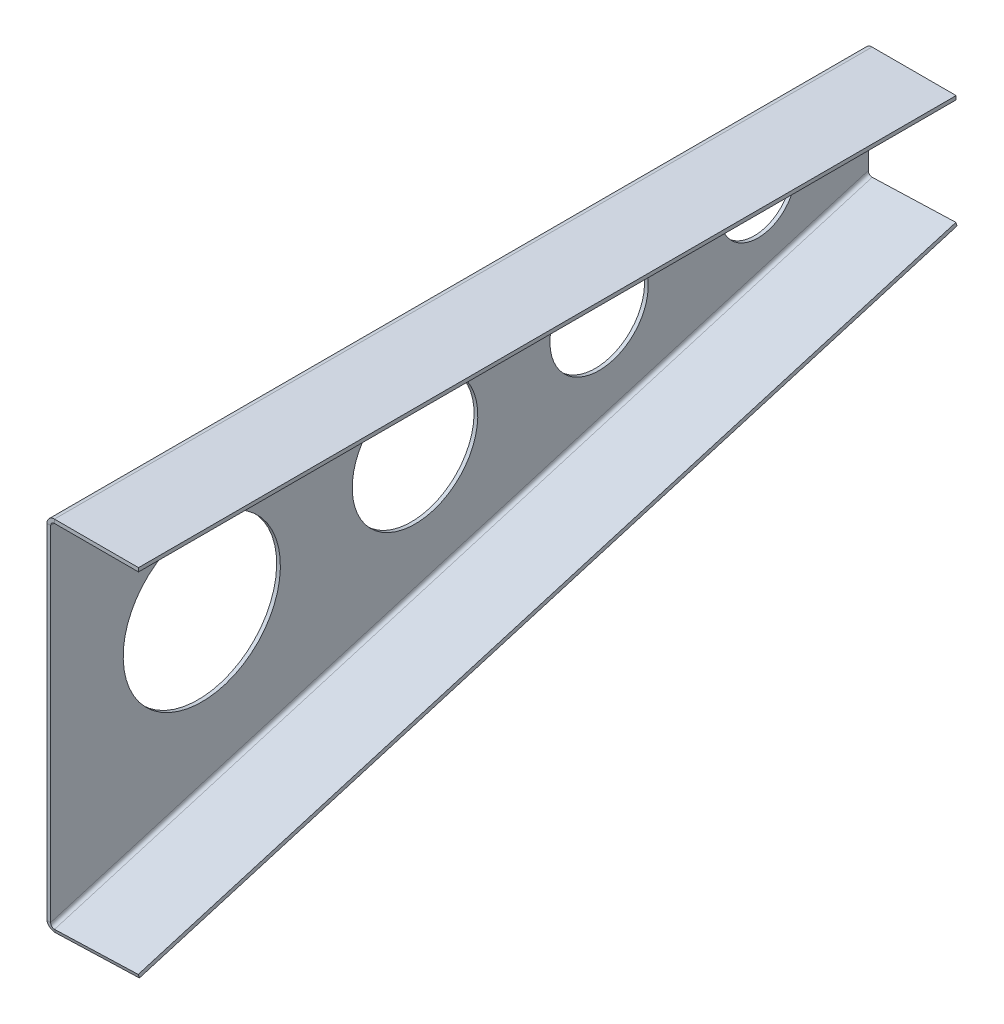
ISO-10303-21;
HEADER;
FILE_DESCRIPTION(('STEP AP214'),'2;1');
FILE_NAME('part.step','',(''),(''),'','','');
FILE_SCHEMA(('AUTOMOTIVE_DESIGN { 1 0 10303 214 1 1 1 1 }'));
ENDSEC;
DATA;
#1=APPLICATION_CONTEXT('core data for automotive mechanical design processes');
#2=APPLICATION_PROTOCOL_DEFINITION('international standard','automotive_design',2000,#1);
#3=PRODUCT_CONTEXT('',#1,'mechanical');
#4=PRODUCT('Part','Part','',(#3));
#5=PRODUCT_RELATED_PRODUCT_CATEGORY('part','',(#4));
#6=PRODUCT_DEFINITION_FORMATION('','',#4);
#7=PRODUCT_DEFINITION_CONTEXT('part definition',#1,'design');
#8=PRODUCT_DEFINITION('design','',#6,#7);
#9=PRODUCT_DEFINITION_SHAPE('','',#8);
#10=(LENGTH_UNIT() NAMED_UNIT(*) SI_UNIT(.MILLI.,.METRE.));
#11=(NAMED_UNIT(*) PLANE_ANGLE_UNIT() SI_UNIT($,.RADIAN.));
#12=(NAMED_UNIT(*) SI_UNIT($,.STERADIAN.) SOLID_ANGLE_UNIT());
#13=UNCERTAINTY_MEASURE_WITH_UNIT(LENGTH_MEASURE(1.E-05),#10,'distance_accuracy_value','');
#14=(GEOMETRIC_REPRESENTATION_CONTEXT(3) GLOBAL_UNCERTAINTY_ASSIGNED_CONTEXT((#13)) GLOBAL_UNIT_ASSIGNED_CONTEXT((#10,
#11,#12)) REPRESENTATION_CONTEXT('',''));
#15=CARTESIAN_POINT('',(0.,0.,0.));
#16=DIRECTION('',(0.,0.,1.));
#17=DIRECTION('',(1.,0.,0.));
#18=AXIS2_PLACEMENT_3D('',#15,#16,#17);
#19=CARTESIAN_POINT('',(-2551.0744,-1.62560000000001,-1431.41579922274));
#20=DIRECTION('',(0.,0.,1.));
#21=DIRECTION('',(0.,-1.,0.));
#22=AXIS2_PLACEMENT_3D('',#19,#20,#21);
#23=PLANE('',#22);
#24=DIRECTION('',(1.,0.,0.));
#25=VECTOR('',#24,1.);
#26=CARTESIAN_POINT('',(-2551.0744,-48.9649261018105,-1431.41579922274));
#27=LINE('',#26,#25);
#28=CARTESIAN_POINT('',(-2552.70000000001,-48.9649261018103,-1431.41579922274));
#29=VERTEX_POINT('',#28);
#30=CARTESIAN_POINT('',(-2551.0744,-48.9649261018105,-1431.41579922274));
#31=VERTEX_POINT('',#30);
#32=EDGE_CURVE('E12',#29,#31,#27,.T.);
#33=ORIENTED_EDGE('',*,*,#32,.F.);
#34=DIRECTION('',(0.,1.,0.));
#35=VECTOR('',#34,1.);
#36=CARTESIAN_POINT('',(-2552.70000000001,1.96301995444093E-11,-1431.41579922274));
#37=LINE('',#36,#35);
#38=CARTESIAN_POINT('',(-2552.70000000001,-4.87679999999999,-1431.41579922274));
#39=VERTEX_POINT('',#38);
#40=EDGE_CURVE('E139',#39,#29,#37,.F.);
#41=ORIENTED_EDGE('',*,*,#40,.F.);
#42=DIRECTION('',(1.,0.,0.));
#43=VECTOR('',#42,1.);
#44=CARTESIAN_POINT('',(-2551.0744,-4.8768,-1431.41579922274));
#45=LINE('',#44,#43);
#46=CARTESIAN_POINT('',(-2551.0744,-4.8768,-1431.41579922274));
#47=VERTEX_POINT('',#46);
#48=EDGE_CURVE('E92',#39,#47,#45,.T.);
#49=ORIENTED_EDGE('',*,*,#48,.T.);
#50=DIRECTION('',(0.,-1.,0.));
#51=VECTOR('',#50,1.);
#52=CARTESIAN_POINT('',(-2551.0744,-1.62560000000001,-1431.41579922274));
#53=LINE('',#52,#51);
#54=EDGE_CURVE('E141',#47,#31,#53,.T.);
#55=ORIENTED_EDGE('',*,*,#54,.T.);
#56=EDGE_LOOP('',(#33,#41,#49,#55));
#57=FACE_BOUND('',#56,.T.);
#58=ADVANCED_FACE('F81',(#57),#23,.F.);
#59=CARTESIAN_POINT('',(-2549.44880000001,-4.87680000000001,-1431.41579922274));
#60=DIRECTION('',(0.,0.,-1.));
#61=DIRECTION('',(-1.,0.,0.));
#62=AXIS2_PLACEMENT_3D('',#59,#60,#61);
#63=PLANE('',#62);
#64=ORIENTED_EDGE('',*,*,#48,.F.);
#65=CARTESIAN_POINT('',(-2549.44880000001,-4.87680000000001,-1431.41579922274));
#66=DIRECTION('',(0.,0.,1.));
#67=DIRECTION('',(1.,0.,0.));
#68=AXIS2_PLACEMENT_3D('',#65,#66,#67);
#69=CIRCLE('',#68,3.2512);
#70=CARTESIAN_POINT('',(-2549.44880000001,-1.62560000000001,-1431.41579922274));
#71=VERTEX_POINT('',#70);
#72=EDGE_CURVE('E350',#39,#71,#69,.F.);
#73=ORIENTED_EDGE('',*,*,#72,.T.);
#74=DIRECTION('',(0.,-1.,0.));
#75=VECTOR('',#74,1.);
#76=CARTESIAN_POINT('',(-2549.44880000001,-3.25120000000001,-1431.41579922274));
#77=LINE('',#76,#75);
#78=CARTESIAN_POINT('',(-2549.44880000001,-3.25120000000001,-1431.41579922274));
#79=VERTEX_POINT('',#78);
#80=EDGE_CURVE('E237',#71,#79,#77,.T.);
#81=ORIENTED_EDGE('',*,*,#80,.T.);
#82=CARTESIAN_POINT('',(-2549.44880000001,-4.87680000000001,-1431.41579922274));
#83=DIRECTION('',(0.,0.,1.));
#84=DIRECTION('',(1.,0.,0.));
#85=AXIS2_PLACEMENT_3D('',#82,#83,#84);
#86=CIRCLE('',#85,1.6256);
#87=EDGE_CURVE('E315',#47,#79,#86,.F.);
#88=ORIENTED_EDGE('',*,*,#87,.F.);
#89=EDGE_LOOP('',(#64,#73,#81,#88));
#90=FACE_BOUND('',#89,.T.);
#91=ADVANCED_FACE('F433',(#90),#63,.T.);
#92=CARTESIAN_POINT('',(-2552.7,-3.25120000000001,-1431.41579922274));
#93=DIRECTION('',(0.,0.,1.));
#94=DIRECTION('',(-1.,0.,0.));
#95=AXIS2_PLACEMENT_3D('',#92,#93,#94);
#96=PLANE('',#95);
#97=ORIENTED_EDGE('',*,*,#80,.F.);
#98=DIRECTION('',(1.,0.,0.));
#99=VECTOR('',#98,1.);
#100=CARTESIAN_POINT('',(0.,-1.6256,-1431.41579922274));
#101=LINE('',#100,#99);
#102=CARTESIAN_POINT('',(-2512.8756588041,-1.62560000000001,-1431.41579922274));
#103=VERTEX_POINT('',#102);
#104=EDGE_CURVE('E184',#103,#71,#101,.F.);
#105=ORIENTED_EDGE('',*,*,#104,.F.);
#106=DIRECTION('',(0.,-1.,0.));
#107=VECTOR('',#106,1.);
#108=CARTESIAN_POINT('',(-2512.8756588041,-3.25120000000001,-1431.41579922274));
#109=LINE('',#108,#107);
#110=CARTESIAN_POINT('',(-2512.8756588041,-3.25120000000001,-1431.41579922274));
#111=VERTEX_POINT('',#110);
#112=EDGE_CURVE('E233',#103,#111,#109,.T.);
#113=ORIENTED_EDGE('',*,*,#112,.T.);
#114=DIRECTION('',(-1.,0.,0.));
#115=VECTOR('',#114,1.);
#116=CARTESIAN_POINT('',(-2552.7,-3.25120000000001,-1431.41579922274));
#117=LINE('',#116,#115);
#118=EDGE_CURVE('E296',#111,#79,#117,.T.);
#119=ORIENTED_EDGE('',*,*,#118,.T.);
#120=EDGE_LOOP('',(#97,#105,#113,#119));
#121=FACE_BOUND('',#120,.T.);
#122=ADVANCED_FACE('F379',(#121),#96,.F.);
#123=CARTESIAN_POINT('',(-2512.8756588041,-3.25120000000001,-1431.41579922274));
#124=DIRECTION('',(-1.,0.,0.));
#125=DIRECTION('',(0.,0.,-1.));
#126=AXIS2_PLACEMENT_3D('',#123,#124,#125);
#127=PLANE('',#126);
#128=ORIENTED_EDGE('',*,*,#112,.F.);
#129=DIRECTION('',(0.,0.,1.));
#130=VECTOR('',#129,1.);
#131=CARTESIAN_POINT('',(-2512.8756588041,-1.62560000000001,0.));
#132=LINE('',#131,#130);
#133=CARTESIAN_POINT('',(-2512.8756588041,-1.62560000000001,-1075.81579922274));
#134=VERTEX_POINT('',#133);
#135=EDGE_CURVE('E195',#134,#103,#132,.F.);
#136=ORIENTED_EDGE('',*,*,#135,.F.);
#137=DIRECTION('',(0.,-1.,0.));
#138=VECTOR('',#137,1.);
#139=CARTESIAN_POINT('',(-2512.8756588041,-3.25120000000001,-1075.81579922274));
#140=LINE('',#139,#138);
#141=CARTESIAN_POINT('',(-2512.8756588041,-3.25120000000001,-1075.81579922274));
#142=VERTEX_POINT('',#141);
#143=EDGE_CURVE('E229',#134,#142,#140,.T.);
#144=ORIENTED_EDGE('',*,*,#143,.T.);
#145=DIRECTION('',(0.,0.,-1.));
#146=VECTOR('',#145,1.);
#147=CARTESIAN_POINT('',(-2512.8756588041,-3.25120000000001,-1431.41579922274));
#148=LINE('',#147,#146);
#149=EDGE_CURVE('E292',#142,#111,#148,.T.);
#150=ORIENTED_EDGE('',*,*,#149,.T.);
#151=EDGE_LOOP('',(#128,#136,#144,#150));
#152=FACE_BOUND('',#151,.T.);
#153=ADVANCED_FACE('F374',(#152),#127,.F.);
#154=CARTESIAN_POINT('',(-2512.8756588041,-3.25120000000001,-1075.81579922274));
#155=DIRECTION('',(0.,0.,-1.));
#156=DIRECTION('',(1.,0.,0.));
#157=AXIS2_PLACEMENT_3D('',#154,#155,#156);
#158=PLANE('',#157);
#159=ORIENTED_EDGE('',*,*,#143,.F.);
#160=DIRECTION('',(1.,0.,0.));
#161=VECTOR('',#160,1.);
#162=CARTESIAN_POINT('',(0.,-1.6256,-1075.81579922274));
#163=LINE('',#162,#161);
#164=CARTESIAN_POINT('',(-2549.4488,-1.62560000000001,-1075.81579922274));
#165=VERTEX_POINT('',#164);
#166=EDGE_CURVE('E179',#165,#134,#163,.T.);
#167=ORIENTED_EDGE('',*,*,#166,.F.);
#168=DIRECTION('',(0.,-1.,0.));
#169=VECTOR('',#168,1.);
#170=CARTESIAN_POINT('',(-2549.4488,-3.25120000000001,-1075.81579922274));
#171=LINE('',#170,#169);
#172=CARTESIAN_POINT('',(-2549.4488,-3.25120000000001,-1075.81579922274));
#173=VERTEX_POINT('',#172);
#174=EDGE_CURVE('E225',#165,#173,#171,.T.);
#175=ORIENTED_EDGE('',*,*,#174,.T.);
#176=DIRECTION('',(1.,0.,0.));
#177=VECTOR('',#176,1.);
#178=CARTESIAN_POINT('',(-2512.8756588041,-3.25120000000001,-1075.81579922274));
#179=LINE('',#178,#177);
#180=EDGE_CURVE('E300',#173,#142,#179,.T.);
#181=ORIENTED_EDGE('',*,*,#180,.T.);
#182=EDGE_LOOP('',(#159,#167,#175,#181));
#183=FACE_BOUND('',#182,.T.);
#184=ADVANCED_FACE('F368',(#183),#158,.F.);
#185=CARTESIAN_POINT('',(-2549.4488,-4.87680000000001,-1075.81579922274));
#186=DIRECTION('',(0.,0.,1.));
#187=DIRECTION('',(1.,0.,0.));
#188=AXIS2_PLACEMENT_3D('',#185,#186,#187);
#189=PLANE('',#188);
#190=ORIENTED_EDGE('',*,*,#174,.F.);
#191=CARTESIAN_POINT('',(-2549.4488,-4.87680000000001,-1075.81579922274));
#192=DIRECTION('',(0.,0.,1.));
#193=DIRECTION('',(1.,0.,0.));
#194=AXIS2_PLACEMENT_3D('',#191,#192,#193);
#195=CIRCLE('',#194,3.2512);
#196=CARTESIAN_POINT('',(-2552.7,-4.87679999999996,-1075.81579922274));
#197=VERTEX_POINT('',#196);
#198=EDGE_CURVE('E186',#165,#197,#195,.T.);
#199=ORIENTED_EDGE('',*,*,#198,.T.);
#200=DIRECTION('',(1.,0.,0.));
#201=VECTOR('',#200,1.);
#202=CARTESIAN_POINT('',(-2551.0744,-4.87679999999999,-1075.81579922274));
#203=LINE('',#202,#201);
#204=CARTESIAN_POINT('',(-2551.0744,-4.87679999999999,-1075.81579922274));
#205=VERTEX_POINT('',#204);
#206=EDGE_CURVE('E222',#197,#205,#203,.T.);
#207=ORIENTED_EDGE('',*,*,#206,.T.);
#208=CARTESIAN_POINT('',(-2549.4488,-4.87680000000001,-1075.81579922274));
#209=DIRECTION('',(0.,0.,-1.));
#210=DIRECTION('',(-1.,0.,0.));
#211=AXIS2_PLACEMENT_3D('',#208,#209,#210);
#212=CIRCLE('',#211,1.6256);
#213=EDGE_CURVE('E311',#173,#205,#212,.F.);
#214=ORIENTED_EDGE('',*,*,#213,.F.);
#215=EDGE_LOOP('',(#190,#199,#207,#214));
#216=FACE_BOUND('',#215,.T.);
#217=ADVANCED_FACE('F362',(#216),#189,.T.);
#218=CARTESIAN_POINT('',(-2551.0744,-157.860490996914,-1075.81579922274));
#219=DIRECTION('',(0.,0.,-1.));
#220=DIRECTION('',(0.,1.,0.));
#221=AXIS2_PLACEMENT_3D('',#218,#219,#220);
#222=PLANE('',#221);
#223=ORIENTED_EDGE('',*,*,#206,.F.);
#224=DIRECTION('',(0.,1.,0.));
#225=VECTOR('',#224,1.);
#226=CARTESIAN_POINT('',(-2552.7,1.96301995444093E-11,-1075.81579922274));
#227=LINE('',#226,#225);
#228=CARTESIAN_POINT('',(-2552.7,-154.429226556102,-1075.81579922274));
#229=VERTEX_POINT('',#228);
#230=EDGE_CURVE('E171',#229,#197,#227,.T.);
#231=ORIENTED_EDGE('',*,*,#230,.F.);
#232=DIRECTION('',(1.,0.,0.));
#233=VECTOR('',#232,1.);
#234=CARTESIAN_POINT('',(-2551.0744,-154.429226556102,-1075.81579922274));
#235=LINE('',#234,#233);
#236=CARTESIAN_POINT('',(-2551.0744,-154.429226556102,-1075.81579922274));
#237=VERTEX_POINT('',#236);
#238=EDGE_CURVE('E218',#229,#237,#235,.T.);
#239=ORIENTED_EDGE('',*,*,#238,.T.);
#240=DIRECTION('',(0.,1.,0.));
#241=VECTOR('',#240,1.);
#242=CARTESIAN_POINT('',(-2551.0744,-157.860490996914,-1075.81579922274));
#243=LINE('',#242,#241);
#244=EDGE_CURVE('E270',#237,#205,#243,.T.);
#245=ORIENTED_EDGE('',*,*,#244,.T.);
#246=EDGE_LOOP('',(#223,#231,#239,#245));
#247=FACE_BOUND('',#246,.T.);
#248=ADVANCED_FACE('F481',(#247),#222,.F.);
#249=CARTESIAN_POINT('',(-2549.4488,-151.175137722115,-1075.35357695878));
#250=CARTESIAN_POINT('',(-2549.4488,-151.694638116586,-1075.50765104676));
#251=CARTESIAN_POINT('',(-2549.4488,-152.214138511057,-1075.66172513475));
#252=CARTESIAN_POINT('',(-2549.4488,-152.733638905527,-1075.81579922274));
#253=CARTESIAN_POINT('',(-2555.9512,-151.175137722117,-1075.35357695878));
#254=CARTESIAN_POINT('',(-2554.86746666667,-151.694638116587,-1075.50765104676));
#255=CARTESIAN_POINT('',(-2553.78373333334,-152.214138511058,-1075.66172513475));
#256=CARTESIAN_POINT('',(-2552.7,-152.733638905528,-1075.81579922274));
#257=CARTESIAN_POINT('',(-2555.9512,-157.683315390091,-1076.2780214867));
#258=CARTESIAN_POINT('',(-2554.86746666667,-157.163814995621,-1076.12394739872));
#259=CARTESIAN_POINT('',(-2553.78373333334,-156.64431460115,-1075.96987331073));
#260=CARTESIAN_POINT('',(-2552.7,-156.124814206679,-1075.81579922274));
#261=CARTESIAN_POINT('',(-2549.4488,-157.68331539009,-1076.2780214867));
#262=CARTESIAN_POINT('',(-2549.4488,-157.163814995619,-1076.12394739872));
#263=CARTESIAN_POINT('',(-2549.4488,-156.644314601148,-1075.96987331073));
#264=CARTESIAN_POINT('',(-2549.4488,-156.124814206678,-1075.81579922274));
#265=CARTESIAN_POINT('',(-2542.9464,-157.683315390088,-1076.2780214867));
#266=CARTESIAN_POINT('',(-2544.03013333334,-157.163814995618,-1076.12394739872));
#267=CARTESIAN_POINT('',(-2545.11386666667,-156.644314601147,-1075.96987331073));
#268=CARTESIAN_POINT('',(-2546.1976,-156.124814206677,-1075.81579922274));
#269=CARTESIAN_POINT('',(-2542.9464,-151.175137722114,-1075.35357695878));
#270=CARTESIAN_POINT('',(-2544.03013333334,-151.694638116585,-1075.50765104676));
#271=CARTESIAN_POINT('',(-2545.11386666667,-152.214138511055,-1075.66172513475));
#272=CARTESIAN_POINT('',(-2546.1976,-152.733638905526,-1075.81579922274));
#273=CARTESIAN_POINT('',(-2549.4488,-151.175137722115,-1075.35357695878));
#274=CARTESIAN_POINT('',(-2549.4488,-151.694638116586,-1075.50765104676));
#275=CARTESIAN_POINT('',(-2549.4488,-152.214138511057,-1075.66172513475));
#276=CARTESIAN_POINT('',(-2549.4488,-152.733638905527,-1075.81579922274));
#277=(BOUNDED_SURFACE() B_SPLINE_SURFACE(3,3,((#249,#250,#251,#252),(#253,#254,#255,#256),(#257,
#258,#259,#260),(#261,#262,#263,#264),(#265,#266,#267,#268),(#269,#270,#271,#272),(#273,#274,
#275,#276)),.UNSPECIFIED.,.T.,.F.,.F.) B_SPLINE_SURFACE_WITH_KNOTS((4,3,4),(4,4),(0.,0.5,1.),
(0.,1.),.UNSPECIFIED.) GEOMETRIC_REPRESENTATION_ITEM() RATIONAL_B_SPLINE_SURFACE(((1.,1.,1.,1.),
(0.333333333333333,0.333333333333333,0.333333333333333,0.333333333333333),(0.333333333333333,
0.333333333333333,0.333333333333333,0.333333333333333),(1.,1.,1.,1.),(0.333333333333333,
0.333333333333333,0.333333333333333,0.333333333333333),(0.333333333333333,0.333333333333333,
0.333333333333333,0.333333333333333),(1.,1.,1.,1.))) REPRESENTATION_ITEM('') SURFACE());
#278=CARTESIAN_POINT('',(-2549.4488,-154.429226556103,-1075.81579922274));
#279=DIRECTION('',(0.,0.140631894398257,-0.990061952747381));
#280=DIRECTION('',(-2.70229764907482E-13,0.990061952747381,0.140631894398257));
#281=AXIS2_PLACEMENT_3D('',#278,#279,#280);
#282=ELLIPSE('',#281,3.28675273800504,3.2512);
#283=CARTESIAN_POINT('',(-2549.34416356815,-157.681629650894,-1076.27778203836));
#284=VERTEX_POINT('',#283);
#285=EDGE_CURVE('E157',#229,#284,#282,.F.);
#286=DIRECTION('',(-0.0321839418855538,0.95822700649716,0.28419218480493));
#287=VECTOR('',#286,1.);
#288=CARTESIAN_POINT('',(-2549.39648178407,-156.123935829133,-1075.81579922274));
#289=LINE('',#288,#287);
#290=CARTESIAN_POINT('',(-2549.39648178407,-156.123935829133,-1075.81579922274));
#291=VERTEX_POINT('',#290);
#292=EDGE_CURVE('E214',#284,#291,#289,.T.);
#293=CARTESIAN_POINT('',(-2549.4488,-154.429226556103,-1075.81579922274));
#294=DIRECTION('',(0.,0.,-1.));
#295=DIRECTION('',(-2.0160959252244E-13,1.,0.));
#296=AXIS2_PLACEMENT_3D('',#293,#294,#295);
#297=ELLIPSE('',#296,1.69558765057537,1.6256);
#298=EDGE_CURVE('E307',#237,#291,#297,.F.);
#299=ORIENTED_EDGE('',*,*,#238,.F.);
#300=ORIENTED_EDGE('',*,*,#285,.T.);
#301=ORIENTED_EDGE('',*,*,#292,.T.);
#302=ORIENTED_EDGE('',*,*,#298,.F.);
#303=EDGE_LOOP('',(#299,#300,#301,#302));
#304=FACE_BOUND('',#303,.T.);
#305=ADVANCED_FACE('F420',(#304),#277,.T.);
#306=CARTESIAN_POINT('',(-2552.7,-156.234890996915,-1075.81579922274));
#307=DIRECTION('',(-0.00953977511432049,0.284032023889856,-0.958767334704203));
#308=DIRECTION('',(-0.999436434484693,-0.0335680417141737,0.));
#309=AXIS2_PLACEMENT_3D('',#306,#307,#308);
#310=PLANE('',#309);
#311=ORIENTED_EDGE('',*,*,#292,.F.);
#312=DIRECTION('',(-0.999436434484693,-0.0335680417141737,0.));
#313=VECTOR('',#312,1.);
#314=CARTESIAN_POINT('',(-2552.64768178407,-157.792584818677,-1076.27778203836));
#315=LINE('',#314,#313);
#316=CARTESIAN_POINT('',(-2512.9435536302,-156.459043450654,-1076.27778203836));
#317=VERTEX_POINT('',#316);
#318=EDGE_CURVE('E330',#317,#284,#315,.T.);
#319=ORIENTED_EDGE('',*,*,#318,.F.);
#320=DIRECTION('',(-0.0321839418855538,0.95822700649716,0.28419218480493));
#321=VECTOR('',#320,1.);
#322=CARTESIAN_POINT('',(-2512.99587184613,-154.901349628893,-1075.81579922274));
#323=LINE('',#322,#321);
#324=CARTESIAN_POINT('',(-2512.99587184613,-154.901349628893,-1075.81579922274));
#325=VERTEX_POINT('',#324);
#326=EDGE_CURVE('E210',#317,#325,#323,.T.);
#327=ORIENTED_EDGE('',*,*,#326,.T.);
#328=DIRECTION('',(-0.999436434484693,-0.0335680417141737,0.));
#329=VECTOR('',#328,1.);
#330=CARTESIAN_POINT('',(-2552.7,-156.234890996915,-1075.81579922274));
#331=LINE('',#330,#329);
#332=EDGE_CURVE('E262',#325,#291,#331,.T.);
#333=ORIENTED_EDGE('',*,*,#332,.T.);
#334=EDGE_LOOP('',(#311,#319,#327,#333));
#335=FACE_BOUND('',#334,.T.);
#336=ADVANCED_FACE('F404',(#335),#310,.F.);
#337=CARTESIAN_POINT('',(-2512.99587184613,-154.901349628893,-1075.81579922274));
#338=DIRECTION('',(-0.999481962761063,-0.0308555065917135,-0.00915116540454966));
#339=DIRECTION('',(0.,-0.284339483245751,0.958723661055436));
#340=AXIS2_PLACEMENT_3D('',#337,#338,#339);
#341=PLANE('',#340);
#342=ORIENTED_EDGE('',*,*,#326,.F.);
#343=DIRECTION('',(0.,-0.284339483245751,0.958723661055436));
#344=VECTOR('',#343,1.);
#345=CARTESIAN_POINT('',(-2512.9435536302,-437.074609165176,-130.110266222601));
#346=LINE('',#345,#344);
#347=CARTESIAN_POINT('',(-2512.9435536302,-50.9947429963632,-1431.87778203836));
#348=VERTEX_POINT('',#347);
#349=EDGE_CURVE('E326',#348,#317,#346,.T.);
#350=ORIENTED_EDGE('',*,*,#349,.F.);
#351=DIRECTION('',(-0.0321839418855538,0.95822700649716,0.28419218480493));
#352=VECTOR('',#351,1.);
#353=CARTESIAN_POINT('',(-2512.99587184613,-49.4370491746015,-1431.41579922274));
#354=LINE('',#353,#352);
#355=CARTESIAN_POINT('',(-2512.99587184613,-49.4370491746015,-1431.41579922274));
#356=VERTEX_POINT('',#355);
#357=EDGE_CURVE('E206',#348,#356,#354,.T.);
#358=ORIENTED_EDGE('',*,*,#357,.T.);
#359=DIRECTION('',(0.,-0.284339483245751,0.958723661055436));
#360=VECTOR('',#359,1.);
#361=CARTESIAN_POINT('',(-2512.99587184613,-154.901349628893,-1075.81579922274));
#362=LINE('',#361,#360);
#363=EDGE_CURVE('E258',#356,#325,#362,.T.);
#364=ORIENTED_EDGE('',*,*,#363,.T.);
#365=EDGE_LOOP('',(#342,#350,#358,#364));
#366=FACE_BOUND('',#365,.T.);
#367=ADVANCED_FACE('F412',(#366),#341,.F.);
#368=CARTESIAN_POINT('',(-2512.99587184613,-49.4370491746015,-1431.41579922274));
#369=DIRECTION('',(0.00953977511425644,-0.284032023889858,0.958767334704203));
#370=DIRECTION('',(0.999436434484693,0.0335680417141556,1.17375926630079E-13));
#371=AXIS2_PLACEMENT_3D('',#368,#369,#370);
#372=PLANE('',#371);
#373=ORIENTED_EDGE('',*,*,#357,.F.);
#374=DIRECTION('',(0.999436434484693,0.0335680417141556,1.17375926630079E-13));
#375=VECTOR('',#374,1.);
#376=CARTESIAN_POINT('',(-2512.9435536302,-50.9947429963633,-1431.87778203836));
#377=LINE('',#376,#375);
#378=CARTESIAN_POINT('',(-2549.34416356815,-52.2173291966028,-1431.87778203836));
#379=VERTEX_POINT('',#378);
#380=EDGE_CURVE('E334',#379,#348,#377,.T.);
#381=ORIENTED_EDGE('',*,*,#380,.F.);
#382=DIRECTION('',(-0.03218394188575,0.958227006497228,0.284192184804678));
#383=VECTOR('',#382,1.);
#384=CARTESIAN_POINT('',(-2549.39648178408,-50.659635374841,-1431.41579922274));
#385=LINE('',#384,#383);
#386=CARTESIAN_POINT('',(-2549.39648178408,-50.659635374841,-1431.41579922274));
#387=VERTEX_POINT('',#386);
#388=EDGE_CURVE('E85',#379,#387,#385,.T.);
#389=ORIENTED_EDGE('',*,*,#388,.T.);
#390=DIRECTION('',(0.999436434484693,0.0335680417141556,1.17375926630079E-13));
#391=VECTOR('',#390,1.);
#392=CARTESIAN_POINT('',(-2512.99587184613,-49.4370491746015,-1431.41579922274));
#393=LINE('',#392,#391);
#394=EDGE_CURVE('E266',#387,#356,#393,.T.);
#395=ORIENTED_EDGE('',*,*,#394,.T.);
#396=EDGE_LOOP('',(#373,#381,#389,#395));
#397=FACE_BOUND('',#396,.T.);
#398=ADVANCED_FACE('F414',(#397),#372,.F.);
#399=CARTESIAN_POINT('',(-2551.07440000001,-34.1250645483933,-1383.44129820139));
#400=DIRECTION('',(1.,0.,0.));
#401=DIRECTION('',(0.,1.,0.));
#402=AXIS2_PLACEMENT_3D('',#399,#400,#401);
#403=CYLINDRICAL_SURFACE('',#402,16.2497322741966);
#404=CARTESIAN_POINT('',(-2551.07440000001,-34.1250645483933,-1383.44129820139));
#405=DIRECTION('',(1.,0.,0.));
#406=DIRECTION('',(0.,1.,0.));
#407=AXIS2_PLACEMENT_3D('',#404,#405,#406);
#408=CIRCLE('',#407,16.2497322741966);
#409=CARTESIAN_POINT('',(-2551.07440000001,-17.8753322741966,-1383.44129820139));
#410=VERTEX_POINT('',#409);
#411=EDGE_CURVE('E288',#410,#410,#408,.F.);
#412=ORIENTED_EDGE('',*,*,#411,.F.);
#413=EDGE_LOOP('',(#412));
#414=FACE_BOUND('',#413,.T.);
#415=CARTESIAN_POINT('',(-2552.70000000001,-34.1250645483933,-1383.44129820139));
#416=DIRECTION('',(1.,0.,0.));
#417=DIRECTION('',(0.,1.,0.));
#418=AXIS2_PLACEMENT_3D('',#415,#416,#417);
#419=CIRCLE('',#418,16.2497322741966);
#420=CARTESIAN_POINT('',(-2552.70000000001,-17.8753322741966,-1383.44129820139));
#421=VERTEX_POINT('',#420);
#422=EDGE_CURVE('E190',#421,#421,#419,.F.);
#423=ORIENTED_EDGE('',*,*,#422,.T.);
#424=EDGE_LOOP('',(#423));
#425=FACE_BOUND('',#424,.T.);
#426=ADVANCED_FACE('F445',(#414,#425),#403,.F.);
#427=CARTESIAN_POINT('',(-2551.0744,-44.3745850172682,-1314.3235121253));
#428=DIRECTION('',(1.,0.,0.));
#429=DIRECTION('',(0.,1.,0.));
#430=AXIS2_PLACEMENT_3D('',#427,#428,#429);
#431=CYLINDRICAL_SURFACE('',#430,21.3744925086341);
#432=CARTESIAN_POINT('',(-2551.0744,-44.3745850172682,-1314.3235121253));
#433=DIRECTION('',(1.,0.,0.));
#434=DIRECTION('',(0.,1.,0.));
#435=AXIS2_PLACEMENT_3D('',#432,#433,#434);
#436=CIRCLE('',#435,21.3744925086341);
#437=CARTESIAN_POINT('',(-2551.0744,-23.0000925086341,-1314.3235121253));
#438=VERTEX_POINT('',#437);
#439=EDGE_CURVE('E284',#438,#438,#436,.F.);
#440=ORIENTED_EDGE('',*,*,#439,.F.);
#441=EDGE_LOOP('',(#440));
#442=FACE_BOUND('',#441,.T.);
#443=CARTESIAN_POINT('',(-2552.70000000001,-44.3745850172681,-1314.3235121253));
#444=DIRECTION('',(1.,0.,0.));
#445=DIRECTION('',(0.,1.,0.));
#446=AXIS2_PLACEMENT_3D('',#443,#444,#445);
#447=CIRCLE('',#446,21.3744925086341);
#448=CARTESIAN_POINT('',(-2552.70000000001,-23.0000925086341,-1314.3235121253));
#449=VERTEX_POINT('',#448);
#450=EDGE_CURVE('E194',#449,#449,#447,.F.);
#451=ORIENTED_EDGE('',*,*,#450,.T.);
#452=EDGE_LOOP('',(#451));
#453=FACE_BOUND('',#452,.T.);
#454=ADVANCED_FACE('F453',(#442,#453),#431,.F.);
#455=CARTESIAN_POINT('',(-2551.0744,-56.2465694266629,-1234.26461754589));
#456=DIRECTION('',(1.,0.,0.));
#457=DIRECTION('',(0.,1.,0.));
#458=AXIS2_PLACEMENT_3D('',#455,#456,#457);
#459=CYLINDRICAL_SURFACE('',#458,27.3104847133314);
#460=CARTESIAN_POINT('',(-2551.0744,-56.2465694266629,-1234.26461754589));
#461=DIRECTION('',(1.,0.,0.));
#462=DIRECTION('',(0.,1.,0.));
#463=AXIS2_PLACEMENT_3D('',#460,#461,#462);
#464=CIRCLE('',#463,27.3104847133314);
#465=CARTESIAN_POINT('',(-2551.0744,-28.9360847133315,-1234.26461754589));
#466=VERTEX_POINT('',#465);
#467=EDGE_CURVE('E280',#466,#466,#464,.F.);
#468=ORIENTED_EDGE('',*,*,#467,.F.);
#469=EDGE_LOOP('',(#468));
#470=FACE_BOUND('',#469,.T.);
#471=CARTESIAN_POINT('',(-2552.7,-56.2465694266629,-1234.26461754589));
#472=DIRECTION('',(1.,0.,0.));
#473=DIRECTION('',(0.,1.,0.));
#474=AXIS2_PLACEMENT_3D('',#471,#472,#473);
#475=CIRCLE('',#474,27.3104847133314);
#476=CARTESIAN_POINT('',(-2552.7,-28.9360847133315,-1234.26461754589));
#477=VERTEX_POINT('',#476);
#478=EDGE_CURVE('E199',#477,#477,#475,.F.);
#479=ORIENTED_EDGE('',*,*,#478,.T.);
#480=EDGE_LOOP('',(#479));
#481=FACE_BOUND('',#480,.T.);
#482=ADVANCED_FACE('F456',(#470,#481),#459,.F.);
#483=CARTESIAN_POINT('',(-2551.0744,-69.9978482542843,-1141.53267450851));
#484=DIRECTION('',(1.,0.,0.));
#485=DIRECTION('',(0.,1.,0.));
#486=AXIS2_PLACEMENT_3D('',#483,#484,#485);
#487=CYLINDRICAL_SURFACE('',#486,34.1861241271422);
#488=CARTESIAN_POINT('',(-2551.0744,-69.9978482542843,-1141.53267450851));
#489=DIRECTION('',(1.,0.,0.));
#490=DIRECTION('',(0.,1.,0.));
#491=AXIS2_PLACEMENT_3D('',#488,#489,#490);
#492=CIRCLE('',#491,34.1861241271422);
#493=CARTESIAN_POINT('',(-2551.0744,-35.8117241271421,-1141.53267450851));
#494=VERTEX_POINT('',#493);
#495=EDGE_CURVE('E276',#494,#494,#492,.F.);
#496=ORIENTED_EDGE('',*,*,#495,.F.);
#497=EDGE_LOOP('',(#496));
#498=FACE_BOUND('',#497,.T.);
#499=CARTESIAN_POINT('',(-2552.7,-69.9978482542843,-1141.53267450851));
#500=DIRECTION('',(1.,0.,0.));
#501=DIRECTION('',(0.,1.,0.));
#502=AXIS2_PLACEMENT_3D('',#499,#500,#501);
#503=CIRCLE('',#502,34.1861241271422);
#504=CARTESIAN_POINT('',(-2552.7,-35.8117241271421,-1141.53267450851));
#505=VERTEX_POINT('',#504);
#506=EDGE_CURVE('E172',#505,#505,#503,.F.);
#507=ORIENTED_EDGE('',*,*,#506,.T.);
#508=EDGE_LOOP('',(#507));
#509=FACE_BOUND('',#508,.T.);
#510=ADVANCED_FACE('F83',(#498,#509),#487,.F.);
#511=CARTESIAN_POINT('',(-2549.44880000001,-45.7108372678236,-1430.95357695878));
#512=CARTESIAN_POINT('',(-2549.44880000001,-46.2303376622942,-1431.10765104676));
#513=CARTESIAN_POINT('',(-2549.44880000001,-46.7498380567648,-1431.26172513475));
#514=CARTESIAN_POINT('',(-2549.44880000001,-47.2693384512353,-1431.41579922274));
#515=CARTESIAN_POINT('',(-2542.94640000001,-45.7108372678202,-1430.95357695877));
#516=CARTESIAN_POINT('',(-2544.03013333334,-46.2303376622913,-1431.10765104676));
#517=CARTESIAN_POINT('',(-2545.11386666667,-46.7498380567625,-1431.26172513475));
#518=CARTESIAN_POINT('',(-2546.19760000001,-47.2693384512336,-1431.41579922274));
#519=CARTESIAN_POINT('',(-2542.9464,-52.2190149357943,-1431.8780214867));
#520=CARTESIAN_POINT('',(-2544.03013333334,-51.6995145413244,-1431.72394739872));
#521=CARTESIAN_POINT('',(-2545.11386666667,-51.1800141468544,-1431.56987331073));
#522=CARTESIAN_POINT('',(-2546.1976,-50.6605137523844,-1431.41579922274));
#523=CARTESIAN_POINT('',(-2549.4488,-52.2190149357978,-1431.8780214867));
#524=CARTESIAN_POINT('',(-2549.4488,-51.6995145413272,-1431.72394739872));
#525=CARTESIAN_POINT('',(-2549.4488,-51.1800141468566,-1431.56987331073));
#526=CARTESIAN_POINT('',(-2549.4488,-50.6605137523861,-1431.41579922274));
#527=CARTESIAN_POINT('',(-2555.9512,-52.2190149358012,-1431.87802148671));
#528=CARTESIAN_POINT('',(-2554.86746666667,-51.6995145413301,-1431.72394739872));
#529=CARTESIAN_POINT('',(-2553.78373333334,-51.1800141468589,-1431.56987331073));
#530=CARTESIAN_POINT('',(-2552.7,-50.6605137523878,-1431.41579922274));
#531=CARTESIAN_POINT('',(-2555.95120000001,-45.710837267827,-1430.95357695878));
#532=CARTESIAN_POINT('',(-2554.86746666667,-46.230337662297,-1431.10765104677));
#533=CARTESIAN_POINT('',(-2553.78373333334,-46.7498380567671,-1431.26172513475));
#534=CARTESIAN_POINT('',(-2552.70000000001,-47.269338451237,-1431.41579922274));
#535=CARTESIAN_POINT('',(-2549.44880000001,-45.7108372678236,-1430.95357695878));
#536=CARTESIAN_POINT('',(-2549.44880000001,-46.2303376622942,-1431.10765104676));
#537=CARTESIAN_POINT('',(-2549.44880000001,-46.7498380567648,-1431.26172513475));
#538=CARTESIAN_POINT('',(-2549.44880000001,-47.2693384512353,-1431.41579922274));
#539=(BOUNDED_SURFACE() B_SPLINE_SURFACE(3,3,((#511,#512,#513,#514),(#515,#516,#517,#518),(#519,
#520,#521,#522),(#523,#524,#525,#526),(#527,#528,#529,#530),(#531,#532,#533,#534),(#535,#536,
#537,#538)),.UNSPECIFIED.,.T.,.F.,.F.) B_SPLINE_SURFACE_WITH_KNOTS((4,3,4),(4,4),(0.,0.5,1.),
(0.,1.),.UNSPECIFIED.) GEOMETRIC_REPRESENTATION_ITEM() RATIONAL_B_SPLINE_SURFACE(((1.,1.,1.,1.),
(0.333333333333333,0.333333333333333,0.333333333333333,0.333333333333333),(0.333333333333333,
0.333333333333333,0.333333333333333,0.333333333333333),(1.,1.,1.,1.),(0.333333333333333,
0.333333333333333,0.333333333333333,0.333333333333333),(0.333333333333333,0.333333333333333,
0.333333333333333,0.333333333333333),(1.,1.,1.,1.))) REPRESENTATION_ITEM('') SURFACE());
#540=CARTESIAN_POINT('',(-2549.44880000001,-48.9649261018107,-1431.41579922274));
#541=DIRECTION('',(0.,-0.140631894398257,0.990061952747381));
#542=DIRECTION('',(-5.40459529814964E-13,0.990061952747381,0.140631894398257));
#543=AXIS2_PLACEMENT_3D('',#540,#541,#542);
#544=ELLIPSE('',#543,3.28675273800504,3.2512);
#545=EDGE_CURVE('E154',#379,#29,#544,.F.);
#546=CARTESIAN_POINT('',(-2549.44880000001,-48.9649261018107,-1431.41579922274));
#547=DIRECTION('',(-1.17442112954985E-13,0.,1.));
#548=DIRECTION('',(-4.09030974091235E-13,1.,0.));
#549=AXIS2_PLACEMENT_3D('',#546,#547,#548);
#550=ELLIPSE('',#549,1.69558765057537,1.6256);
#551=EDGE_CURVE('E304',#387,#31,#550,.F.);
#552=ORIENTED_EDGE('',*,*,#545,.T.);
#553=ORIENTED_EDGE('',*,*,#32,.T.);
#554=ORIENTED_EDGE('',*,*,#551,.F.);
#555=ORIENTED_EDGE('',*,*,#388,.F.);
#556=EDGE_LOOP('',(#552,#553,#554,#555));
#557=FACE_BOUND('',#556,.T.);
#558=ADVANCED_FACE('F175',(#557),#539,.T.);
#559=CARTESIAN_POINT('',(12.0641081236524,-357.564528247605,-106.529065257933));
#560=DIRECTION('',(-0.0321839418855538,0.95822700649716,0.28419218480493));
#561=DIRECTION('',(0.,-0.284339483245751,0.958723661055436));
#562=AXIS2_PLACEMENT_3D('',#559,#560,#561);
#563=PLANE('',#562);
#564=ORIENTED_EDGE('',*,*,#394,.F.);
#565=DIRECTION('',(0.,-0.284339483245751,0.958723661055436));
#566=VECTOR('',#565,1.);
#567=CARTESIAN_POINT('',(-2549.39648178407,-156.128492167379,-1075.80043635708));
#568=LINE('',#567,#566);
#569=EDGE_CURVE('E254',#387,#291,#568,.T.);
#570=ORIENTED_EDGE('',*,*,#569,.T.);
#571=ORIENTED_EDGE('',*,*,#332,.F.);
#572=ORIENTED_EDGE('',*,*,#363,.F.);
#573=EDGE_LOOP('',(#564,#570,#571,#572));
#574=FACE_BOUND('',#573,.T.);
#575=ADVANCED_FACE('F410',(#574),#563,.T.);
#576=CARTESIAN_POINT('',(-2551.0744,1.96177066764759E-11,1.56963117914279E-11));
#577=DIRECTION('',(1.,0.,0.));
#578=DIRECTION('',(0.,1.,0.));
#579=AXIS2_PLACEMENT_3D('',#576,#577,#578);
#580=PLANE('',#579);
#581=ORIENTED_EDGE('',*,*,#411,.T.);
#582=EDGE_LOOP('',(#581));
#583=FACE_BOUND('',#582,.T.);
#584=ORIENTED_EDGE('',*,*,#439,.T.);
#585=EDGE_LOOP('',(#584));
#586=FACE_BOUND('',#585,.T.);
#587=ORIENTED_EDGE('',*,*,#467,.T.);
#588=EDGE_LOOP('',(#587));
#589=FACE_BOUND('',#588,.T.);
#590=ORIENTED_EDGE('',*,*,#495,.T.);
#591=EDGE_LOOP('',(#590));
#592=FACE_BOUND('',#591,.T.);
#593=ORIENTED_EDGE('',*,*,#54,.F.);
#594=DIRECTION('',(0.,0.,-1.));
#595=VECTOR('',#594,1.);
#596=CARTESIAN_POINT('',(-2551.0744,-4.8768,-1075.81579922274));
#597=LINE('',#596,#595);
#598=EDGE_CURVE('E244',#47,#205,#597,.F.);
#599=ORIENTED_EDGE('',*,*,#598,.T.);
#600=ORIENTED_EDGE('',*,*,#244,.F.);
#601=DIRECTION('',(0.,-0.284339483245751,0.958723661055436));
#602=VECTOR('',#601,1.);
#603=CARTESIAN_POINT('',(-2551.07440000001,-49.1064978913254,-1430.93845354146));
#604=LINE('',#603,#602);
#605=EDGE_CURVE('E251',#237,#31,#604,.F.);
#606=ORIENTED_EDGE('',*,*,#605,.T.);
#607=EDGE_LOOP('',(#593,#599,#600,#606));
#608=FACE_BOUND('',#607,.T.);
#609=ADVANCED_FACE('F472',(#583,#586,#589,#592,#608),#580,.T.);
#610=CARTESIAN_POINT('',(0.,-3.2512,0.));
#611=DIRECTION('',(0.,-1.,0.));
#612=DIRECTION('',(1.,0.,0.));
#613=AXIS2_PLACEMENT_3D('',#610,#611,#612);
#614=PLANE('',#613);
#615=ORIENTED_EDGE('',*,*,#180,.F.);
#616=DIRECTION('',(0.,0.,-1.));
#617=VECTOR('',#616,1.);
#618=CARTESIAN_POINT('',(-2549.44880000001,-3.25120000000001,-1431.41579922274));
#619=LINE('',#618,#617);
#620=EDGE_CURVE('E247',#173,#79,#619,.T.);
#621=ORIENTED_EDGE('',*,*,#620,.T.);
#622=ORIENTED_EDGE('',*,*,#118,.F.);
#623=ORIENTED_EDGE('',*,*,#149,.F.);
#624=EDGE_LOOP('',(#615,#621,#622,#623));
#625=FACE_BOUND('',#624,.T.);
#626=ADVANCED_FACE('F382',(#625),#614,.T.);
#627=CARTESIAN_POINT('',(-2549.4488,-435.08296292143,-129.519581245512));
#628=DIRECTION('',(0.,0.284339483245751,-0.958723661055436));
#629=DIRECTION('',(0.,0.958723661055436,0.284339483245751));
#630=AXIS2_PLACEMENT_3D('',#627,#628,#629);
#631=CYLINDRICAL_SURFACE('',#630,1.6256);
#632=ORIENTED_EDGE('',*,*,#551,.T.);
#633=ORIENTED_EDGE('',*,*,#605,.F.);
#634=ORIENTED_EDGE('',*,*,#298,.T.);
#635=ORIENTED_EDGE('',*,*,#569,.F.);
#636=EDGE_LOOP('',(#632,#633,#634,#635));
#637=FACE_BOUND('',#636,.T.);
#638=ADVANCED_FACE('F417',(#637),#631,.F.);
#639=CARTESIAN_POINT('',(-2549.4488,-4.87680000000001,1.56741767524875E-11));
#640=DIRECTION('',(0.,0.,1.));
#641=DIRECTION('',(1.,0.,0.));
#642=AXIS2_PLACEMENT_3D('',#639,#640,#641);
#643=CYLINDRICAL_SURFACE('',#642,1.6256);
#644=ORIENTED_EDGE('',*,*,#213,.T.);
#645=ORIENTED_EDGE('',*,*,#598,.F.);
#646=ORIENTED_EDGE('',*,*,#87,.T.);
#647=ORIENTED_EDGE('',*,*,#620,.F.);
#648=EDGE_LOOP('',(#644,#645,#646,#647));
#649=FACE_BOUND('',#648,.T.);
#650=ADVANCED_FACE('F385',(#649),#643,.F.);
#651=CARTESIAN_POINT('',(12.1164263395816,-359.122222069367,-106.991048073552));
#652=DIRECTION('',(-0.0321839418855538,0.95822700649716,0.28419218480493));
#653=DIRECTION('',(0.,-0.284339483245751,0.958723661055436));
#654=AXIS2_PLACEMENT_3D('',#651,#652,#653);
#655=PLANE('',#654);
#656=ORIENTED_EDGE('',*,*,#380,.T.);
#657=ORIENTED_EDGE('',*,*,#349,.T.);
#658=ORIENTED_EDGE('',*,*,#318,.T.);
#659=DIRECTION('',(0.,-0.284339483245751,0.958723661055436));
#660=VECTOR('',#659,1.);
#661=CARTESIAN_POINT('',(-2549.34416356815,-438.198350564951,-130.443546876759));
#662=LINE('',#661,#660);
#663=EDGE_CURVE('E163',#379,#284,#662,.T.);
#664=ORIENTED_EDGE('',*,*,#663,.F.);
#665=EDGE_LOOP('',(#656,#657,#658,#664));
#666=FACE_BOUND('',#665,.T.);
#667=ADVANCED_FACE('F422',(#666),#655,.F.);
#668=CARTESIAN_POINT('',(-2552.7,1.96301995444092E-11,1.57063060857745E-11));
#669=DIRECTION('',(1.,0.,0.));
#670=DIRECTION('',(0.,1.,0.));
#671=AXIS2_PLACEMENT_3D('',#668,#669,#670);
#672=PLANE('',#671);
#673=ORIENTED_EDGE('',*,*,#422,.F.);
#674=EDGE_LOOP('',(#673));
#675=FACE_BOUND('',#674,.T.);
#676=ORIENTED_EDGE('',*,*,#450,.F.);
#677=EDGE_LOOP('',(#676));
#678=FACE_BOUND('',#677,.T.);
#679=ORIENTED_EDGE('',*,*,#478,.F.);
#680=EDGE_LOOP('',(#679));
#681=FACE_BOUND('',#680,.T.);
#682=ORIENTED_EDGE('',*,*,#506,.F.);
#683=EDGE_LOOP('',(#682));
#684=FACE_BOUND('',#683,.T.);
#685=ORIENTED_EDGE('',*,*,#40,.T.);
#686=DIRECTION('',(0.,0.284339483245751,-0.958723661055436));
#687=VECTOR('',#686,1.);
#688=CARTESIAN_POINT('',(-2552.7,-435.08296292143,-129.519581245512));
#689=LINE('',#688,#687);
#690=EDGE_CURVE('E151',#229,#29,#689,.T.);
#691=ORIENTED_EDGE('',*,*,#690,.F.);
#692=ORIENTED_EDGE('',*,*,#230,.T.);
#693=DIRECTION('',(0.,0.,1.));
#694=VECTOR('',#693,1.);
#695=CARTESIAN_POINT('',(-2552.7,-4.87679999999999,1.57063060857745E-11));
#696=LINE('',#695,#694);
#697=EDGE_CURVE('E168',#39,#197,#696,.T.);
#698=ORIENTED_EDGE('',*,*,#697,.F.);
#699=EDGE_LOOP('',(#685,#691,#692,#698));
#700=FACE_BOUND('',#699,.T.);
#701=ADVANCED_FACE('F166',(#675,#678,#681,#684,#700),#672,.F.);
#702=CARTESIAN_POINT('',(0.,-1.6256,0.));
#703=DIRECTION('',(0.,-1.,0.));
#704=DIRECTION('',(1.,0.,0.));
#705=AXIS2_PLACEMENT_3D('',#702,#703,#704);
#706=PLANE('',#705);
#707=ORIENTED_EDGE('',*,*,#166,.T.);
#708=ORIENTED_EDGE('',*,*,#135,.T.);
#709=ORIENTED_EDGE('',*,*,#104,.T.);
#710=DIRECTION('',(0.,0.,1.));
#711=VECTOR('',#710,1.);
#712=CARTESIAN_POINT('',(-2549.4488,-1.62560000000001,0.));
#713=LINE('',#712,#711);
#714=EDGE_CURVE('E162',#165,#71,#713,.F.);
#715=ORIENTED_EDGE('',*,*,#714,.F.);
#716=EDGE_LOOP('',(#707,#708,#709,#715));
#717=FACE_BOUND('',#716,.T.);
#718=ADVANCED_FACE('F372',(#717),#706,.F.);
#719=CARTESIAN_POINT('',(-2549.4488,-435.08296292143,-129.519581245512));
#720=DIRECTION('',(0.,0.284339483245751,-0.958723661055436));
#721=DIRECTION('',(0.,0.958723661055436,0.284339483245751));
#722=AXIS2_PLACEMENT_3D('',#719,#720,#721);
#723=CYLINDRICAL_SURFACE('',#722,3.2512);
#724=ORIENTED_EDGE('',*,*,#545,.F.);
#725=ORIENTED_EDGE('',*,*,#663,.T.);
#726=ORIENTED_EDGE('',*,*,#285,.F.);
#727=ORIENTED_EDGE('',*,*,#690,.T.);
#728=EDGE_LOOP('',(#724,#725,#726,#727));
#729=FACE_BOUND('',#728,.T.);
#730=ADVANCED_FACE('F152',(#729),#723,.T.);
#731=CARTESIAN_POINT('',(-2549.4488,-4.87680000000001,1.56741767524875E-11));
#732=DIRECTION('',(0.,0.,1.));
#733=DIRECTION('',(1.,0.,0.));
#734=AXIS2_PLACEMENT_3D('',#731,#732,#733);
#735=CYLINDRICAL_SURFACE('',#734,3.2512);
#736=ORIENTED_EDGE('',*,*,#198,.F.);
#737=ORIENTED_EDGE('',*,*,#714,.T.);
#738=ORIENTED_EDGE('',*,*,#72,.F.);
#739=ORIENTED_EDGE('',*,*,#697,.T.);
#740=EDGE_LOOP('',(#736,#737,#738,#739));
#741=FACE_BOUND('',#740,.T.);
#742=ADVANCED_FACE('F366',(#741),#735,.T.);
#743=CLOSED_SHELL('',(#58,#91,#122,#153,#184,#217,#248,#305,#336,#367,#398,#426,#454,#482,#510,
#558,#575,#609,#626,#638,#650,#667,#701,#718,#730,#742));
#744=MANIFOLD_SOLID_BREP('B2',#743);
#745=ADVANCED_BREP_SHAPE_REPRESENTATION('',(#18,#744),#14);
#746=SHAPE_DEFINITION_REPRESENTATION(#9,#745);
ENDSEC;
END-ISO-10303-21;
